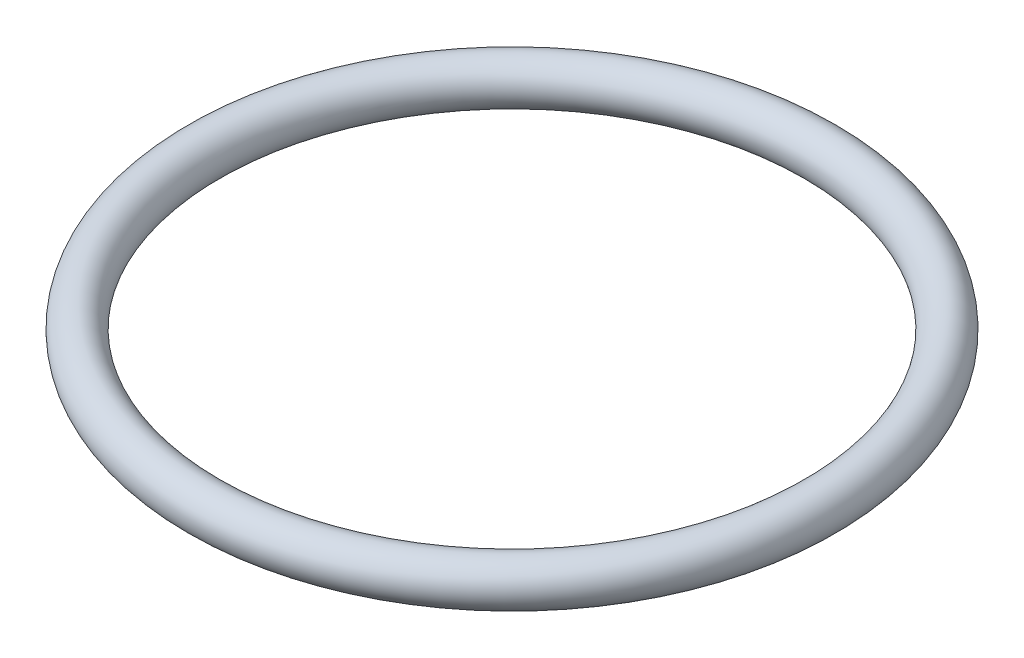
from build123d import *

# Parameters (mm, degrees)
ESQUISSE1_R = 1


with BuildPart() as part:
    # Esquisse1 → R_volution1 (revolve)
    with BuildSketch(Plane.XY, mode=Mode.PRIVATE) as r_volution1_sk:
        with Locations((14, 0)):
            Circle(ESQUISSE1_R)
    revolve(r_volution1_sk.sketch.rotate(Axis((0, 27.80530303, 0), (0, -1, 0)), 90), axis=Axis((0, 27.80530303, 0), (0, -1, 0)))


solid = part.part
